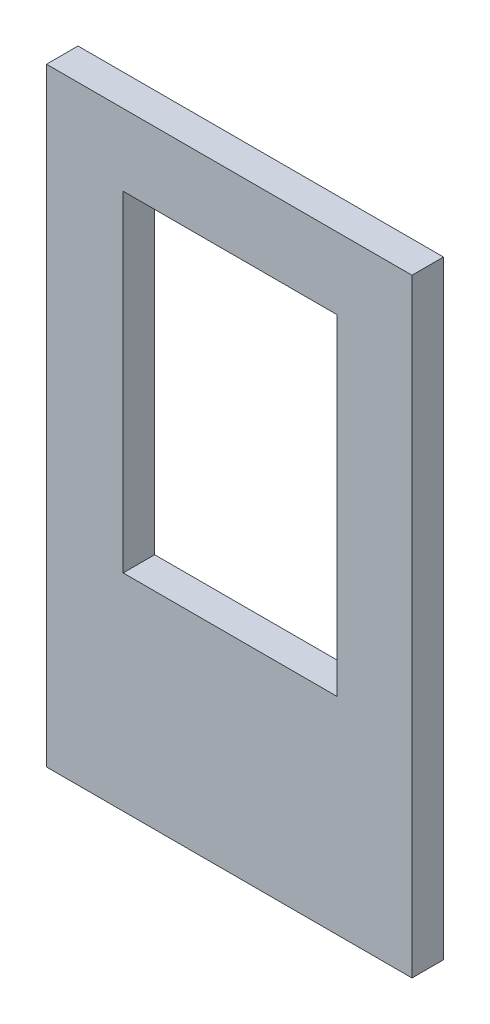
from build123d import *

# Parameters (mm, degrees)
ESQUISSE1_W             = 118.3
ESQUISSE1_H             = 197
BOSS_EXTRU_1_DEPTH      = 5.1
ESQUISSE2_W             = 69.3
ESQUISSE2_H             = 107
ENL_V_MAT_EXTRU_1_DEPTH = 437.722940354


with BuildPart() as part:
    # Esquisse1 → Boss.-Extru.1 (new, symmetric)
    with BuildSketch(Plane.XY):
        Rectangle(ESQUISSE1_W, ESQUISSE1_H)
    extrude(amount=BOSS_EXTRU_1_DEPTH, both=True)

    # Esquisse2 → Enl_v. mat.-Extru.1 (cut, through all)
    with BuildSketch(Plane(origin=(-353.65, -41.036542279, -24.1), x_dir=(-1, 0, 0), z_dir=(0, 0, -1))):
        with Locations((-353.95, 62.836542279)):
            Rectangle(ESQUISSE2_W, ESQUISSE2_H)
    extrude(amount=-ENL_V_MAT_EXTRU_1_DEPTH, mode=Mode.SUBTRACT)


solid = part.part
